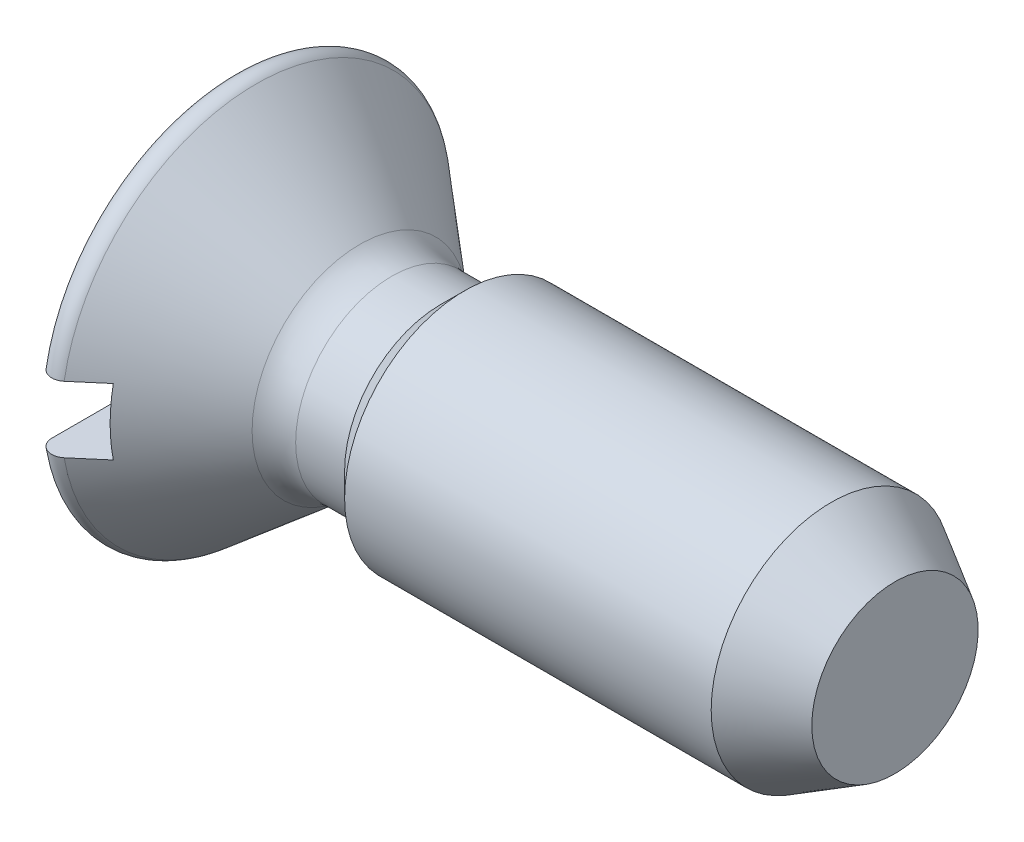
ISO-10303-21;
HEADER;
FILE_DESCRIPTION(('STEP AP214'),'2;1');
FILE_NAME('part.step','',(''),(''),'','','');
FILE_SCHEMA(('AUTOMOTIVE_DESIGN { 1 0 10303 214 1 1 1 1 }'));
ENDSEC;
DATA;
#1=APPLICATION_CONTEXT('core data for automotive mechanical design processes');
#2=APPLICATION_PROTOCOL_DEFINITION('international standard','automotive_design',2000,#1);
#3=PRODUCT_CONTEXT('',#1,'mechanical');
#4=PRODUCT('Part','Part','',(#3));
#5=PRODUCT_RELATED_PRODUCT_CATEGORY('part','',(#4));
#6=PRODUCT_DEFINITION_FORMATION('','',#4);
#7=PRODUCT_DEFINITION_CONTEXT('part definition',#1,'design');
#8=PRODUCT_DEFINITION('design','',#6,#7);
#9=PRODUCT_DEFINITION_SHAPE('','',#8);
#10=(LENGTH_UNIT() NAMED_UNIT(*) SI_UNIT(.MILLI.,.METRE.));
#11=(NAMED_UNIT(*) PLANE_ANGLE_UNIT() SI_UNIT($,.RADIAN.));
#12=(NAMED_UNIT(*) SI_UNIT($,.STERADIAN.) SOLID_ANGLE_UNIT());
#13=UNCERTAINTY_MEASURE_WITH_UNIT(LENGTH_MEASURE(1.E-05),#10,'distance_accuracy_value','');
#14=(GEOMETRIC_REPRESENTATION_CONTEXT(3) GLOBAL_UNCERTAINTY_ASSIGNED_CONTEXT((#13)) GLOBAL_UNIT_ASSIGNED_CONTEXT((#10,
#11,#12)) REPRESENTATION_CONTEXT('',''));
#15=CARTESIAN_POINT('',(0.,0.,0.));
#16=DIRECTION('',(0.,0.,1.));
#17=DIRECTION('',(1.,0.,0.));
#18=AXIS2_PLACEMENT_3D('',#15,#16,#17);
#19=CARTESIAN_POINT('',(0.,0.,0.));
#20=DIRECTION('',(-1.,0.,0.));
#21=DIRECTION('',(0.,0.,1.));
#22=AXIS2_PLACEMENT_3D('',#19,#20,#21);
#23=CYLINDRICAL_SURFACE('',#22,1.45);
#24=CARTESIAN_POINT('',(2.8,0.,0.));
#25=DIRECTION('',(-1.,0.,0.));
#26=DIRECTION('',(0.,0.,1.));
#27=AXIS2_PLACEMENT_3D('',#24,#25,#26);
#28=CIRCLE('',#27,1.45);
#29=CARTESIAN_POINT('',(2.8,0.,1.45));
#30=VERTEX_POINT('',#29);
#31=EDGE_CURVE('E209',#30,#30,#28,.T.);
#32=ORIENTED_EDGE('',*,*,#31,.F.);
#33=EDGE_LOOP('',(#32));
#34=FACE_BOUND('',#33,.T.);
#35=CARTESIAN_POINT('',(7.22923739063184,0.,0.));
#36=DIRECTION('',(-1.,0.,0.));
#37=DIRECTION('',(0.,0.,1.));
#38=AXIS2_PLACEMENT_3D('',#35,#36,#37);
#39=CIRCLE('',#38,1.45);
#40=CARTESIAN_POINT('',(7.22923739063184,0.,1.45));
#41=VERTEX_POINT('',#40);
#42=EDGE_CURVE('E324',#41,#41,#39,.T.);
#43=ORIENTED_EDGE('',*,*,#42,.T.);
#44=EDGE_LOOP('',(#43));
#45=FACE_BOUND('',#44,.T.);
#46=ADVANCED_FACE('F70',(#34,#45),#23,.T.);
#47=CARTESIAN_POINT('',(0.17,0.,0.));
#48=DIRECTION('',(-1.,0.,0.));
#49=DIRECTION('',(0.,0.,1.));
#50=AXIS2_PLACEMENT_3D('',#47,#48,#49);
#51=TOROIDAL_SURFACE('',#50,2.22190319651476,0.17);
#52=CARTESIAN_POINT('',(0.279273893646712,0.,0.));
#53=DIRECTION('',(-1.,0.,0.));
#54=DIRECTION('',(0.,0.,1.));
#55=AXIS2_PLACEMENT_3D('',#52,#53,#54);
#56=CIRCLE('',#55,2.35213075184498);
#57=CARTESIAN_POINT('',(0.279273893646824,0.4,2.31786951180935));
#58=VERTEX_POINT('',#57);
#59=CARTESIAN_POINT('',(0.279273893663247,0.4,-2.31786951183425));
#60=VERTEX_POINT('',#59);
#61=EDGE_CURVE('E197',#58,#60,#56,.T.);
#62=ORIENTED_EDGE('',*,*,#61,.T.);
#63=CARTESIAN_POINT('',(0.0659222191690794,0.4,-2.32212033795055));
#64=CARTESIAN_POINT('',(0.0583198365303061,0.4,-2.3161465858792));
#65=CARTESIAN_POINT('',(0.0512215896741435,0.4,-2.30951878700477));
#66=CARTESIAN_POINT('',(0.0382374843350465,0.4,-2.29515578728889));
#67=CARTESIAN_POINT('',(0.0323533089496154,0.4,-2.28741907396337));
#68=CARTESIAN_POINT('',(0.0219681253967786,0.4,-2.27107878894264));
#69=CARTESIAN_POINT('',(0.017465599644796,0.4,-2.26247618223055));
#70=CARTESIAN_POINT('',(0.00995282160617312,0.4,-2.24464584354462));
#71=CARTESIAN_POINT('',(0.00694219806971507,0.4,-2.23541826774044));
#72=CARTESIAN_POINT('',(0.00246190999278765,0.4,-2.21649259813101));
#73=CARTESIAN_POINT('',(0.00100896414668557,0.4,-2.20679054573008));
#74=CARTESIAN_POINT('',(-0.000263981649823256,0.4,-2.1872792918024));
#75=CARTESIAN_POINT('',(-8.38074140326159E-05,0.4,-2.17747007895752));
#76=CARTESIAN_POINT('',(0.00191244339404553,0.4,-2.15792760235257));
#77=CARTESIAN_POINT('',(0.00374360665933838,0.4,-2.14819587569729));
#78=CARTESIAN_POINT('',(0.00901422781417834,0.4,-2.12917773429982));
#79=CARTESIAN_POINT('',(0.0124537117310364,0.4,-2.11989132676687));
#80=CARTESIAN_POINT('',(0.0208482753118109,0.4,-2.10203610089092));
#81=CARTESIAN_POINT('',(0.0258025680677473,0.4,-2.09346691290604));
#82=CARTESIAN_POINT('',(0.0370951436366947,0.4,-2.07729438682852));
#83=CARTESIAN_POINT('',(0.0434333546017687,0.4,-2.06969099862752));
#84=CARTESIAN_POINT('',(0.0572400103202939,0.4,-2.05576290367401));
#85=CARTESIAN_POINT('',(0.0646946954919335,0.4,-2.04942456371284));
#86=CARTESIAN_POINT('',(0.0805788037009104,0.4,-2.03811665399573));
#87=CARTESIAN_POINT('',(0.0890081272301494,0.4,-2.03314694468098));
#88=CARTESIAN_POINT('',(0.106440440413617,0.4,-2.02481211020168));
#89=CARTESIAN_POINT('',(0.115430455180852,0.4,-2.02141984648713));
#90=CARTESIAN_POINT('',(0.1338574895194,0.4,-2.01621961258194));
#91=CARTESIAN_POINT('',(0.143294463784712,0.4,-2.01441148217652));
#92=CARTESIAN_POINT('',(0.162191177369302,0.4,-2.01245395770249));
#93=CARTESIAN_POINT('',(0.171648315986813,0.4,-2.01227938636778));
#94=CARTESIAN_POINT('',(0.190456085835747,0.4,-2.013528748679));
#95=CARTESIAN_POINT('',(0.199806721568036,0.4,-2.0149526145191));
#96=CARTESIAN_POINT('',(0.218092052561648,0.4,-2.01934279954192));
#97=CARTESIAN_POINT('',(0.227028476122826,0.4,-2.02230193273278));
#98=CARTESIAN_POINT('',(0.244283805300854,0.4,-2.02966612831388));
#99=CARTESIAN_POINT('',(0.252602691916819,0.4,-2.03407123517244));
#100=CARTESIAN_POINT('',(0.268465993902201,0.4,-2.04423741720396));
#101=CARTESIAN_POINT('',(0.276003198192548,0.4,-2.05000973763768));
#102=CARTESIAN_POINT('',(0.290021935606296,0.4,-2.06271843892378));
#103=CARTESIAN_POINT('',(0.296503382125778,0.4,-2.06965491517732));
#104=CARTESIAN_POINT('',(0.308344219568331,0.4,-2.08461999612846));
#105=CARTESIAN_POINT('',(0.313682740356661,0.4,-2.0926651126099));
#106=CARTESIAN_POINT('',(0.32295953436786,0.4,-2.10952569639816));
#107=CARTESIAN_POINT('',(0.326897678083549,0.4,-2.11834123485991));
#108=CARTESIAN_POINT('',(0.333327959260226,0.4,-2.13665156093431));
#109=CARTESIAN_POINT('',(0.335794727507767,0.4,-2.14615526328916));
#110=CARTESIAN_POINT('',(0.339113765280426,0.4,-2.16544071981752));
#111=CARTESIAN_POINT('',(0.339965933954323,0.4,-2.17522249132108));
#112=CARTESIAN_POINT('',(0.340032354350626,0.4,-2.1948802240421));
#113=CARTESIAN_POINT('',(0.339231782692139,0.4,-2.20475623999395));
#114=CARTESIAN_POINT('',(0.335980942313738,0.4,-2.22423326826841));
#115=CARTESIAN_POINT('',(0.33353066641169,0.4,-2.23383427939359));
#116=CARTESIAN_POINT('',(0.327048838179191,0.4,-2.25246625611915));
#117=CARTESIAN_POINT('',(0.323020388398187,0.4,-2.26149830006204));
#118=CARTESIAN_POINT('',(0.313488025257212,0.4,-2.27874742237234));
#119=CARTESIAN_POINT('',(0.307984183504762,0.4,-2.28696454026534));
#120=CARTESIAN_POINT('',(0.295719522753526,0.4,-2.30225179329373));
#121=CARTESIAN_POINT('',(0.288973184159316,0.4,-2.30933354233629));
#122=CARTESIAN_POINT('',(0.274371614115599,0.4,-2.32224315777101));
#123=CARTESIAN_POINT('',(0.266516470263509,0.4,-2.32807112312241));
#124=CARTESIAN_POINT('',(0.250044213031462,0.4,-2.33821703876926));
#125=CARTESIAN_POINT('',(0.241439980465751,0.4,-2.34255590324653));
#126=CARTESIAN_POINT('',(0.22361914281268,0.4,-2.34970648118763));
#127=CARTESIAN_POINT('',(0.214402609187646,0.4,-2.35251837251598));
#128=CARTESIAN_POINT('',(0.195742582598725,0.4,-2.35650224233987));
#129=CARTESIAN_POINT('',(0.186303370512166,0.4,-2.3576942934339));
#130=CARTESIAN_POINT('',(0.167356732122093,0.4,-2.35846698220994));
#131=CARTESIAN_POINT('',(0.157849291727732,0.4,-2.35804727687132));
#132=CARTESIAN_POINT('',(0.139091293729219,0.4,-2.3556156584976));
#133=CARTESIAN_POINT('',(0.129839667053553,0.4,-2.35361193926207));
#134=CARTESIAN_POINT('',(0.111811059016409,0.4,-2.34808445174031));
#135=CARTESIAN_POINT('',(0.103033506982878,0.4,-2.34456255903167));
#136=CARTESIAN_POINT('',(0.0895433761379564,0.4,-2.33779256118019));
#137=CARTESIAN_POINT('',(0.0846012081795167,0.4,-2.33499152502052));
#138=CARTESIAN_POINT('',(0.0750221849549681,0.4,-2.32890890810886));
#139=CARTESIAN_POINT('',(0.0703853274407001,0.4,-2.32562733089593));
#140=CARTESIAN_POINT('',(0.0659222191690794,0.4,-2.32212033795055));
#141=B_SPLINE_CURVE_WITH_KNOTS('',3,(#63,#64,#65,#66,#67,#68,#69,#70,#71,#72,#73,#74,#75,#76,
#77,#78,#79,#80,#81,#82,#83,#84,#85,#86,#87,#88,#89,#90,#91,#92,#93,#94,#95,#96,#97,#98,#99,
#100,#101,#102,#103,#104,#105,#106,#107,#108,#109,#110,#111,#112,#113,#114,#115,#116,#117,#118,
#119,#120,#121,#122,#123,#124,#125,#126,#127,#128,#129,#130,#131,#132,#133,#134,#135,#136,#137,
#138,#139,#140),.UNSPECIFIED.,.T.,.F.,(4,2,2,2,2,2,2,2,2,2,2,2,2,2,2,2,2,2,2,2,2,2,2,2,2,2,2,2,
2,2,2,2,2,2,2,2,2,2,4),(0.,0.0289847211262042,0.0580093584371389,0.0870020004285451,
0.11598742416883,0.145280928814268,0.174577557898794,0.204144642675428,0.233712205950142,
0.263264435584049,0.292815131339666,0.322027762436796,0.351237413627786,0.379924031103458,
0.408607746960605,0.436848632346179,0.465088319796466,0.493197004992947,0.521306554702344,
0.549655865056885,0.578007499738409,0.606839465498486,0.635674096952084,0.664992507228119,
0.694312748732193,0.723897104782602,0.753481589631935,0.783008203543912,0.812533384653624,
0.841734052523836,0.870932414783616,0.899702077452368,0.928468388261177,0.956874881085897,
0.985287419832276,1.01355394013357,1.0417856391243,1.05880173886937,1.07581771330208),.UNSPECIFIED.);
#142=CARTESIAN_POINT('',(0.,0.4,-2.18560147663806));
#143=VERTEX_POINT('',#142);
#144=EDGE_CURVE('E93',#60,#143,#141,.T.);
#145=ORIENTED_EDGE('',*,*,#144,.T.);
#146=CARTESIAN_POINT('',(0.,0.,0.));
#147=DIRECTION('',(-1.,0.,0.));
#148=DIRECTION('',(0.,0.,1.));
#149=AXIS2_PLACEMENT_3D('',#146,#147,#148);
#150=CIRCLE('',#149,2.22190319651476);
#151=CARTESIAN_POINT('',(0.,0.4,2.18560147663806));
#152=VERTEX_POINT('',#151);
#153=EDGE_CURVE('E193',#152,#143,#150,.T.);
#154=ORIENTED_EDGE('',*,*,#153,.F.);
#155=CARTESIAN_POINT('',(0.0818966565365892,0.4,2.03762447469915));
#156=CARTESIAN_POINT('',(0.0736818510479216,0.4,2.04269808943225));
#157=CARTESIAN_POINT('',(0.0658948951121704,0.4,2.0484793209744));
#158=CARTESIAN_POINT('',(0.0514006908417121,0.4,2.06127754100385));
#159=CARTESIAN_POINT('',(0.0446949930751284,0.4,2.06829627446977));
#160=CARTESIAN_POINT('',(0.0325586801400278,0.4,2.08334693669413));
#161=CARTESIAN_POINT('',(0.0271265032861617,0.4,2.09137760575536));
#162=CARTESIAN_POINT('',(0.0176696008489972,0.4,2.10822501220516));
#163=CARTESIAN_POINT('',(0.0136445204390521,0.4,2.11704155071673));
#164=CARTESIAN_POINT('',(0.00706018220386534,0.4,2.13533159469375));
#165=CARTESIAN_POINT('',(0.00451999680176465,0.4,2.14481196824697));
#166=CARTESIAN_POINT('',(0.00105068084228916,0.4,2.16406370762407));
#167=CARTESIAN_POINT('',(0.000121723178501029,0.4,2.17383510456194));
#168=CARTESIAN_POINT('',(-0.000100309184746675,0.4,2.1934874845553));
#169=CARTESIAN_POINT('',(0.000621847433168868,0.4,2.20336864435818));
#170=CARTESIAN_POINT('',(0.00371739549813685,0.4,2.22286918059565));
#171=CARTESIAN_POINT('',(0.00609079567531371,0.4,2.2324885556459));
#172=CARTESIAN_POINT('',(0.0124234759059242,0.4,2.25117258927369));
#173=CARTESIAN_POINT('',(0.016380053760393,0.4,2.26023816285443));
#174=CARTESIAN_POINT('',(0.0257751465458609,0.4,2.27756618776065));
#175=CARTESIAN_POINT('',(0.0312135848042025,0.4,2.28582868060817));
#176=CARTESIAN_POINT('',(0.0433575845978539,0.4,2.30121813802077));
#177=CARTESIAN_POINT('',(0.0500487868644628,0.4,2.30835643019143));
#178=CARTESIAN_POINT('',(0.0645505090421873,0.4,2.32138773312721));
#179=CARTESIAN_POINT('',(0.0723609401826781,0.4,2.32728084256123));
#180=CARTESIAN_POINT('',(0.0887561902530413,0.4,2.33756268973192));
#181=CARTESIAN_POINT('',(0.0973279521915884,0.4,2.3419722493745));
#182=CARTESIAN_POINT('',(0.115096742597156,0.4,2.34926871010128));
#183=CARTESIAN_POINT('',(0.124293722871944,0.4,2.35215572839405));
#184=CARTESIAN_POINT('',(0.142927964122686,0.4,2.35629069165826));
#185=CARTESIAN_POINT('',(0.152360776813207,0.4,2.35755869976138));
#186=CARTESIAN_POINT('',(0.171304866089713,0.4,2.35848281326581));
#187=CARTESIAN_POINT('',(0.180816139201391,0.4,2.35813898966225));
#188=CARTESIAN_POINT('',(0.199588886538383,0.4,2.35585693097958));
#189=CARTESIAN_POINT('',(0.208851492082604,0.4,2.35392798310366));
#190=CARTESIAN_POINT('',(0.226922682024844,0.4,2.34854648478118));
#191=CARTESIAN_POINT('',(0.235731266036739,0.4,2.34509393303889));
#192=CARTESIAN_POINT('',(0.252672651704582,0.4,2.3367575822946));
#193=CARTESIAN_POINT('',(0.260803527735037,0.4,2.33186987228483));
#194=CARTESIAN_POINT('',(0.276140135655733,0.4,2.32081188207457));
#195=CARTESIAN_POINT('',(0.283345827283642,0.4,2.31464154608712));
#196=CARTESIAN_POINT('',(0.29670894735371,0.4,2.30112756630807));
#197=CARTESIAN_POINT('',(0.30285480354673,0.4,2.2937724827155));
#198=CARTESIAN_POINT('',(0.313845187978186,0.4,2.27814727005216));
#199=CARTESIAN_POINT('',(0.318689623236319,0.4,2.26987707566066));
#200=CARTESIAN_POINT('',(0.327013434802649,0.4,2.2525297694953));
#201=CARTESIAN_POINT('',(0.330472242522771,0.4,2.24344278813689));
#202=CARTESIAN_POINT('',(0.335837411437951,0.4,2.22482154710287));
#203=CARTESIAN_POINT('',(0.337743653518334,0.4,2.21528725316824));
#204=CARTESIAN_POINT('',(0.339972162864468,0.4,2.19590850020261));
#205=CARTESIAN_POINT('',(0.340273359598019,0.4,2.18606161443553));
#206=CARTESIAN_POINT('',(0.339229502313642,0.4,2.16645524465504));
#207=CARTESIAN_POINT('',(0.337884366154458,0.4,2.15669576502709));
#208=CARTESIAN_POINT('',(0.333570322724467,0.4,2.137478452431));
#209=CARTESIAN_POINT('',(0.330591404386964,0.4,2.12802286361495));
#210=CARTESIAN_POINT('',(0.323081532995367,0.4,2.1097490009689));
#211=CARTESIAN_POINT('',(0.318550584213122,0.4,2.10093072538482));
#212=CARTESIAN_POINT('',(0.308081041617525,0.4,2.08422859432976));
#213=CARTESIAN_POINT('',(0.302148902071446,0.4,2.07634069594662));
#214=CARTESIAN_POINT('',(0.289026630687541,0.4,2.06169117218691));
#215=CARTESIAN_POINT('',(0.281836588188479,0.4,2.05492946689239));
#216=CARTESIAN_POINT('',(0.266512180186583,0.4,2.04283228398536));
#217=CARTESIAN_POINT('',(0.258393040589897,0.4,2.03747752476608));
#218=CARTESIAN_POINT('',(0.241358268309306,0.4,2.0282368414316));
#219=CARTESIAN_POINT('',(0.232442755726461,0.4,2.02435069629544));
#220=CARTESIAN_POINT('',(0.214243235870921,0.4,2.01823018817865));
#221=CARTESIAN_POINT('',(0.204968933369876,0.4,2.01596695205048));
#222=CARTESIAN_POINT('',(0.186168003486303,0.4,2.01305096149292));
#223=CARTESIAN_POINT('',(0.176641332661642,0.4,2.01239848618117));
#224=CARTESIAN_POINT('',(0.157730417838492,0.4,2.01272376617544));
#225=CARTESIAN_POINT('',(0.148345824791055,0.4,2.01368227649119));
#226=CARTESIAN_POINT('',(0.129879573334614,0.4,2.01716203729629));
#227=CARTESIAN_POINT('',(0.120797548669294,0.4,2.0196813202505));
#228=CARTESIAN_POINT('',(0.106750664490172,0.4,2.02487802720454));
#229=CARTESIAN_POINT('',(0.101604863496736,0.4,2.02708033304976));
#230=CARTESIAN_POINT('',(0.0915570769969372,0.4,2.0319841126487));
#231=CARTESIAN_POINT('',(0.0866550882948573,0.4,2.03468557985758));
#232=CARTESIAN_POINT('',(0.0818966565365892,0.4,2.03762447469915));
#233=B_SPLINE_CURVE_WITH_KNOTS('',3,(#155,#156,#157,#158,#159,#160,#161,#162,#163,#164,#165,
#166,#167,#168,#169,#170,#171,#172,#173,#174,#175,#176,#177,#178,#179,#180,#181,#182,#183,#184,
#185,#186,#187,#188,#189,#190,#191,#192,#193,#194,#195,#196,#197,#198,#199,#200,#201,#202,#203,
#204,#205,#206,#207,#208,#209,#210,#211,#212,#213,#214,#215,#216,#217,#218,#219,#220,#221,#222,
#223,#224,#225,#226,#227,#228,#229,#230,#231,#232),.UNSPECIFIED.,.T.,.F.,(4,2,2,2,2,2,2,2,2,2,2,
2,2,2,2,2,2,2,2,2,2,2,2,2,2,2,2,2,2,2,2,2,2,2,2,2,2,2,4),(0.,0.0289449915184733,
0.0579311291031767,0.086881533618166,0.11582463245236,0.145131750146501,0.174442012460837,
0.204023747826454,0.23360563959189,0.263137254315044,0.292667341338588,0.321877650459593,
0.351085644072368,0.379864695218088,0.408641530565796,0.437058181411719,0.465473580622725,
0.493723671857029,0.521973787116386,0.55030161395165,0.578630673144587,0.607251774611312,
0.635874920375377,0.664908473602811,0.693944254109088,0.723360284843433,0.75277778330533,
0.782377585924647,0.811977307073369,0.841443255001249,0.870907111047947,0.899943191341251,
0.928974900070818,0.957476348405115,0.985982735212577,1.01415099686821,1.04228382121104,
1.05905044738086,1.07581685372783),.UNSPECIFIED.);
#234=EDGE_CURVE('E142',#152,#58,#233,.T.);
#235=ORIENTED_EDGE('',*,*,#234,.T.);
#236=EDGE_LOOP('',(#62,#145,#154,#235));
#237=FACE_BOUND('',#236,.T.);
#238=ADVANCED_FACE('F221',(#237),#51,.T.);
#239=CARTESIAN_POINT('',(0.,0.,0.));
#240=DIRECTION('',(1.,0.,0.));
#241=DIRECTION('',(0.,0.,-1.));
#242=AXIS2_PLACEMENT_3D('',#239,#240,#241);
#243=PLANE('',#242);
#244=ORIENTED_EDGE('',*,*,#153,.T.);
#245=DIRECTION('',(0.,0.,1.));
#246=VECTOR('',#245,1.);
#247=CARTESIAN_POINT('',(0.,0.4,0.));
#248=LINE('',#247,#246);
#249=EDGE_CURVE('E213',#143,#152,#248,.T.);
#250=ORIENTED_EDGE('',*,*,#249,.T.);
#251=EDGE_LOOP('',(#244,#250));
#252=FACE_BOUND('',#251,.T.);
#253=ADVANCED_FACE('F226',(#252),#243,.F.);
#254=CARTESIAN_POINT('',(2.8,0.,0.));
#255=DIRECTION('',(1.,0.,0.));
#256=DIRECTION('',(0.,0.,-1.));
#257=AXIS2_PLACEMENT_3D('',#254,#255,#256);
#258=CONICAL_SURFACE('',#257,1.45,0.785398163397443);
#259=CARTESIAN_POINT('',(2.51,0.,0.));
#260=DIRECTION('',(-1.,0.,0.));
#261=DIRECTION('',(0.,0.,1.));
#262=AXIS2_PLACEMENT_3D('',#259,#260,#261);
#263=CIRCLE('',#262,1.16);
#264=CARTESIAN_POINT('',(2.51,0.,1.16));
#265=VERTEX_POINT('',#264);
#266=EDGE_CURVE('E206',#265,#265,#263,.T.);
#267=ORIENTED_EDGE('',*,*,#266,.F.);
#268=EDGE_LOOP('',(#267));
#269=FACE_BOUND('',#268,.T.);
#270=ORIENTED_EDGE('',*,*,#31,.T.);
#271=EDGE_LOOP('',(#270));
#272=FACE_BOUND('',#271,.T.);
#273=ADVANCED_FACE('F237',(#269,#272),#258,.T.);
#274=CARTESIAN_POINT('',(0.,0.,0.));
#275=DIRECTION('',(-1.,0.,0.));
#276=DIRECTION('',(0.,0.,1.));
#277=AXIS2_PLACEMENT_3D('',#274,#275,#276);
#278=CYLINDRICAL_SURFACE('',#277,1.16);
#279=CARTESIAN_POINT('',(1.91838214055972,0.,0.));
#280=DIRECTION('',(-1.,0.,0.));
#281=DIRECTION('',(0.,0.,1.));
#282=AXIS2_PLACEMENT_3D('',#279,#280,#281);
#283=CIRCLE('',#282,1.16);
#284=CARTESIAN_POINT('',(1.91838214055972,0.,1.16));
#285=VERTEX_POINT('',#284);
#286=EDGE_CURVE('E203',#285,#285,#283,.T.);
#287=ORIENTED_EDGE('',*,*,#286,.F.);
#288=EDGE_LOOP('',(#287));
#289=FACE_BOUND('',#288,.T.);
#290=ORIENTED_EDGE('',*,*,#266,.T.);
#291=EDGE_LOOP('',(#290));
#292=FACE_BOUND('',#291,.T.);
#293=ADVANCED_FACE('F240',(#289,#292),#278,.T.);
#294=CARTESIAN_POINT('',(1.91838214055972,0.,0.));
#295=DIRECTION('',(-1.,0.,0.));
#296=DIRECTION('',(0.,0.,1.));
#297=AXIS2_PLACEMENT_3D('',#294,#295,#296);
#298=TOROIDAL_SURFACE('',#297,1.76,0.6);
#299=CARTESIAN_POINT('',(1.5327095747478,0.,0.));
#300=DIRECTION('',(-1.,0.,0.));
#301=DIRECTION('',(0.,0.,1.));
#302=AXIS2_PLACEMENT_3D('',#299,#300,#301);
#303=CIRCLE('',#302,1.30037333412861);
#304=CARTESIAN_POINT('',(1.5327095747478,0.,1.30037333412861));
#305=VERTEX_POINT('',#304);
#306=EDGE_CURVE('E200',#305,#305,#303,.T.);
#307=ORIENTED_EDGE('',*,*,#306,.F.);
#308=EDGE_LOOP('',(#307));
#309=FACE_BOUND('',#308,.T.);
#310=ORIENTED_EDGE('',*,*,#286,.T.);
#311=EDGE_LOOP('',(#310));
#312=FACE_BOUND('',#311,.T.);
#313=ADVANCED_FACE('F227',(#309,#312),#298,.F.);
#314=CARTESIAN_POINT('',(1.5327095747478,0.,0.));
#315=DIRECTION('',(-1.,0.,0.));
#316=DIRECTION('',(0.,0.,1.));
#317=AXIS2_PLACEMENT_3D('',#314,#315,#316);
#318=CONICAL_SURFACE('',#317,1.30037333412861,0.698131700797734);
#319=CARTESIAN_POINT('',(0.6,0.,0.));
#320=DIRECTION('',(1.,0.,0.));
#321=DIRECTION('',(0.,0.,-1.));
#322=AXIS2_PLACEMENT_3D('',#319,#320,#321);
#323=CIRCLE('',#322,2.08300959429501);
#324=CARTESIAN_POINT('',(0.6,-0.4,-2.04424288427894));
#325=VERTEX_POINT('',#324);
#326=CARTESIAN_POINT('',(0.6,0.4,-2.04424288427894));
#327=VERTEX_POINT('',#326);
#328=EDGE_CURVE('E43',#325,#327,#323,.T.);
#329=ORIENTED_EDGE('',*,*,#328,.T.);
#330=CARTESIAN_POINT('',(-2.55003532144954,0.4,4.7092457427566));
#331=CARTESIAN_POINT('',(-2.36866257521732,0.4,4.5565043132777));
#332=CARTESIAN_POINT('',(-2.18731269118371,0.4,4.40373570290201));
#333=CARTESIAN_POINT('',(-1.82468195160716,0.4,4.09811033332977));
#334=CARTESIAN_POINT('',(-1.64340109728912,0.4,3.94525357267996));
#335=CARTESIAN_POINT('',(-1.28082171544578,0.4,3.63932528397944));
#336=CARTESIAN_POINT('',(-1.09952325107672,0.4,3.48625368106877));
#337=CARTESIAN_POINT('',(-0.737074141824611,0.4,3.17994146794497));
#338=CARTESIAN_POINT('',(-0.555923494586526,0.4,3.02670086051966));
#339=CARTESIAN_POINT('',(-0.189959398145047,0.4,2.71665911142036));
#340=CARTESIAN_POINT('',(-0.00515084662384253,0.4,2.55985218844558));
#341=CARTESIAN_POINT('',(0.364085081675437,0.4,2.24577137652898));
#342=CARTESIAN_POINT('',(0.548512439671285,0.4,2.08849746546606));
#343=CARTESIAN_POINT('',(0.824542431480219,0.4,1.85195640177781));
#344=CARTESIAN_POINT('',(0.916430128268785,0.4,1.7730220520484));
#345=CARTESIAN_POINT('',(1.09992081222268,0.4,1.61482330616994));
#346=CARTESIAN_POINT('',(1.19152380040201,0.4,1.53555891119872));
#347=CARTESIAN_POINT('',(1.3742794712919,0.4,1.3765269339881));
#348=CARTESIAN_POINT('',(1.46543218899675,0.4,1.29675939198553));
#349=CARTESIAN_POINT('',(1.6470030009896,0.4,1.13639386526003));
#350=CARTESIAN_POINT('',(1.73742111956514,0.4,1.05579590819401));
#351=CARTESIAN_POINT('',(1.87608053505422,0.4,0.930016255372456));
#352=CARTESIAN_POINT('',(1.92481780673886,0.4,0.885382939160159));
#353=CARTESIAN_POINT('',(2.02165860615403,0.4,0.795391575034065));
#354=CARTESIAN_POINT('',(2.06976185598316,0.4,0.75003322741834));
#355=CARTESIAN_POINT('',(2.16493799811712,0.4,0.658198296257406));
#356=CARTESIAN_POINT('',(2.21201048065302,0.4,0.611721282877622));
#357=CARTESIAN_POINT('',(2.28114976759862,0.4,0.540600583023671));
#358=CARTESIAN_POINT('',(2.30394335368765,0.4,0.51666834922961));
#359=CARTESIAN_POINT('',(2.34882117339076,0.4,0.468150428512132));
#360=CARTESIAN_POINT('',(2.37090540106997,0.4,0.443564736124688));
#361=CARTESIAN_POINT('',(2.42240662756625,0.4,0.383816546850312));
#362=CARTESIAN_POINT('',(2.45135989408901,0.4,0.348237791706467));
#363=CARTESIAN_POINT('',(2.49190782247,0.4,0.292809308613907));
#364=CARTESIAN_POINT('',(2.50492952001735,0.4,0.274013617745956));
#365=CARTESIAN_POINT('',(2.52956992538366,0.4,0.235532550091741));
#366=CARTESIAN_POINT('',(2.54118993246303,0.4,0.215848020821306));
#367=CARTESIAN_POINT('',(2.56227212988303,0.4,0.175577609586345));
#368=CARTESIAN_POINT('',(2.57175475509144,0.4,0.155002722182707));
#369=CARTESIAN_POINT('',(2.5877391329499,0.4,0.112722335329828));
#370=CARTESIAN_POINT('',(2.59424657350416,0.4,0.0910190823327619));
#371=CARTESIAN_POINT('',(2.6032585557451,0.4,0.0463845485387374));
#372=CARTESIAN_POINT('',(2.60569842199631,0.4,0.0234393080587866));
#373=CARTESIAN_POINT('',(2.60576628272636,0.4,-0.022431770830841));
#374=CARTESIAN_POINT('',(2.6033991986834,0.4,-0.0453576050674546));
#375=CARTESIAN_POINT('',(2.59390530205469,0.4,-0.0930674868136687));
#376=CARTESIAN_POINT('',(2.58623358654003,0.4,-0.11773750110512));
#377=CARTESIAN_POINT('',(2.57196135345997,0.4,-0.153629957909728));
#378=CARTESIAN_POINT('',(2.56672423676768,0.4,-0.165440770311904));
#379=CARTESIAN_POINT('',(2.55550186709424,0.4,-0.188700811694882));
#380=CARTESIAN_POINT('',(2.54951679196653,0.4,-0.200150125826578));
#381=CARTESIAN_POINT('',(2.53108467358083,0.4,-0.233254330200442));
#382=CARTESIAN_POINT('',(2.51782350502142,0.4,-0.254452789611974));
#383=CARTESIAN_POINT('',(2.48984173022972,0.4,-0.295872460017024));
#384=CARTESIAN_POINT('',(2.47511946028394,0.4,-0.316092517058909));
#385=CARTESIAN_POINT('',(2.42940407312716,0.4,-0.375766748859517));
#386=CARTESIAN_POINT('',(2.39695105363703,0.4,-0.414092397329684));
#387=CARTESIAN_POINT('',(2.32979796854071,0.4,-0.489337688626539));
#388=CARTESIAN_POINT('',(2.29507894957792,0.4,-0.526239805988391));
#389=CARTESIAN_POINT('',(2.22456791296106,0.4,-0.598834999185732));
#390=CARTESIAN_POINT('',(2.18877858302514,0.4,-0.634530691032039));
#391=CARTESIAN_POINT('',(2.11724700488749,0.4,-0.704436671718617));
#392=CARTESIAN_POINT('',(2.08151972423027,0.4,-0.738662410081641));
#393=CARTESIAN_POINT('',(2.00959655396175,0.4,-0.806618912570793));
#394=CARTESIAN_POINT('',(1.97340065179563,0.4,-0.840349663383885));
#395=CARTESIAN_POINT('',(1.86431577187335,0.4,-0.941023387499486));
#396=CARTESIAN_POINT('',(1.7909400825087,0.4,-1.00743779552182));
#397=CARTESIAN_POINT('',(1.64339029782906,0.4,-1.13955245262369));
#398=CARTESIAN_POINT('',(1.56921533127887,0.4,-1.20525172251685));
#399=CARTESIAN_POINT('',(1.42042618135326,0.4,-1.33613828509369));
#400=CARTESIAN_POINT('',(1.34581203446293,0.4,-1.40132561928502));
#401=CARTESIAN_POINT('',(1.12295313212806,0.4,-1.59516793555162));
#402=CARTESIAN_POINT('',(0.974291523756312,0.4,-1.72334293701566));
#403=CARTESIAN_POINT('',(0.676484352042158,0.4,-1.97898426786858));
#404=CARTESIAN_POINT('',(0.527339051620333,0.4,-2.10645090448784));
#405=CARTESIAN_POINT('',(0.13634292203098,0.4,-2.43976405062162));
#406=CARTESIAN_POINT('',(-0.105767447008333,0.4,-2.64530601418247));
#407=CARTESIAN_POINT('',(-0.590430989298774,0.4,-3.05595827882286));
#408=CARTESIAN_POINT('',(-0.832984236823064,0.4,-3.26106849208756));
#409=CARTESIAN_POINT('',(-1.32122757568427,0.4,-3.67347534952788));
#410=CARTESIAN_POINT('',(-1.56692042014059,0.4,-3.88076873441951));
#411=CARTESIAN_POINT('',(-2.05840937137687,0.4,-4.29513674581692));
#412=CARTESIAN_POINT('',(-2.30420544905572,0.4,-4.50221140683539));
#413=CARTESIAN_POINT('',(-2.55003532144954,0.4,-4.70924574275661));
#414=B_SPLINE_CURVE_WITH_KNOTS('',3,(#330,#331,#332,#333,#334,#335,#336,#337,#338,#339,#340,
#341,#342,#343,#344,#345,#346,#347,#348,#349,#350,#351,#352,#353,#354,#355,#356,#357,#358,#359,
#360,#361,#362,#363,#364,#365,#366,#367,#368,#369,#370,#371,#372,#373,#374,#375,#376,#377,#378,
#379,#380,#381,#382,#383,#384,#385,#386,#387,#388,#389,#390,#391,#392,#393,#394,#395,#396,#397,
#398,#399,#400,#401,#402,#403,#404,#405,#406,#407,#408,#409,#410,#411,#412,#413),.UNSPECIFIED.,
.F.,.F.,(4,2,2,2,2,2,2,2,2,2,2,2,2,2,2,2,2,2,2,2,2,2,2,2,2,2,2,2,2,2,2,2,2,2,2,2,2,2,2,2,2,4),
(0.,0.711360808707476,1.42273370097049,2.1345625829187,2.84637989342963,3.57348591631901,
4.30062694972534,4.66403513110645,5.0274420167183,5.39082019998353,5.75418631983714,
5.95244162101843,6.15078110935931,6.34919806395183,6.44833523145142,6.54747322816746,
6.68491641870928,6.75347314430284,6.8219658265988,6.8897729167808,6.95744982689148,
7.02619289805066,7.09486562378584,7.17190735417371,7.21064990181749,7.24938325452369,
7.324295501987,7.39929405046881,7.54979223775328,7.70176989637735,7.85339355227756,
8.00181513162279,8.15024069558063,8.44713530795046,8.74439519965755,9.04163073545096,
9.63049121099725,10.2190724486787,11.1718479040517,12.1248013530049,13.089176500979,
14.0533654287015),.UNSPECIFIED.);
#415=EDGE_CURVE('E192',#327,#60,#414,.T.);
#416=ORIENTED_EDGE('',*,*,#415,.T.);
#417=ORIENTED_EDGE('',*,*,#61,.F.);
#418=CARTESIAN_POINT('',(0.6,0.4,2.04424288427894));
#419=VERTEX_POINT('',#418);
#420=EDGE_CURVE('E145',#58,#419,#414,.T.);
#421=ORIENTED_EDGE('',*,*,#420,.T.);
#422=CARTESIAN_POINT('',(0.6,-0.4,2.04424288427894));
#423=VERTEX_POINT('',#422);
#424=EDGE_CURVE('E74',#419,#423,#323,.T.);
#425=ORIENTED_EDGE('',*,*,#424,.T.);
#426=CARTESIAN_POINT('',(-2.55003532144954,-0.4,-4.7092457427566));
#427=CARTESIAN_POINT('',(-2.36866257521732,-0.4,-4.5565043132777));
#428=CARTESIAN_POINT('',(-2.18731269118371,-0.4,-4.40373570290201));
#429=CARTESIAN_POINT('',(-1.82468195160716,-0.4,-4.09811033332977));
#430=CARTESIAN_POINT('',(-1.64340109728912,-0.4,-3.94525357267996));
#431=CARTESIAN_POINT('',(-1.28082171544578,-0.4,-3.63932528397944));
#432=CARTESIAN_POINT('',(-1.09952325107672,-0.4,-3.48625368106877));
#433=CARTESIAN_POINT('',(-0.737074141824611,-0.4,-3.17994146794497));
#434=CARTESIAN_POINT('',(-0.555923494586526,-0.4,-3.02670086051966));
#435=CARTESIAN_POINT('',(-0.189959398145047,-0.4,-2.71665911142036));
#436=CARTESIAN_POINT('',(-0.00515084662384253,-0.4,-2.55985218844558));
#437=CARTESIAN_POINT('',(0.364085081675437,-0.4,-2.24577137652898));
#438=CARTESIAN_POINT('',(0.548512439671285,-0.4,-2.08849746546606));
#439=CARTESIAN_POINT('',(0.824542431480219,-0.4,-1.85195640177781));
#440=CARTESIAN_POINT('',(0.916430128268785,-0.4,-1.7730220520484));
#441=CARTESIAN_POINT('',(1.09992081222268,-0.4,-1.61482330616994));
#442=CARTESIAN_POINT('',(1.19152380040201,-0.4,-1.53555891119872));
#443=CARTESIAN_POINT('',(1.3742794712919,-0.4,-1.3765269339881));
#444=CARTESIAN_POINT('',(1.46543218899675,-0.4,-1.29675939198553));
#445=CARTESIAN_POINT('',(1.6470030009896,-0.4,-1.13639386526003));
#446=CARTESIAN_POINT('',(1.73742111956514,-0.4,-1.05579590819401));
#447=CARTESIAN_POINT('',(1.87608053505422,-0.4,-0.930016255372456));
#448=CARTESIAN_POINT('',(1.92481780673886,-0.4,-0.885382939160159));
#449=CARTESIAN_POINT('',(2.02165860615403,-0.4,-0.795391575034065));
#450=CARTESIAN_POINT('',(2.06976185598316,-0.4,-0.75003322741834));
#451=CARTESIAN_POINT('',(2.16493799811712,-0.4,-0.658198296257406));
#452=CARTESIAN_POINT('',(2.21201048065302,-0.4,-0.611721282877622));
#453=CARTESIAN_POINT('',(2.28114976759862,-0.4,-0.540600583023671));
#454=CARTESIAN_POINT('',(2.30394335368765,-0.4,-0.51666834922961));
#455=CARTESIAN_POINT('',(2.34882117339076,-0.4,-0.468150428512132));
#456=CARTESIAN_POINT('',(2.37090540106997,-0.4,-0.443564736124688));
#457=CARTESIAN_POINT('',(2.42240662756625,-0.4,-0.383816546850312));
#458=CARTESIAN_POINT('',(2.45135989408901,-0.4,-0.348237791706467));
#459=CARTESIAN_POINT('',(2.49190782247,-0.4,-0.292809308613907));
#460=CARTESIAN_POINT('',(2.50492952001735,-0.4,-0.274013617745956));
#461=CARTESIAN_POINT('',(2.52956992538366,-0.4,-0.235532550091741));
#462=CARTESIAN_POINT('',(2.54118993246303,-0.4,-0.215848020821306));
#463=CARTESIAN_POINT('',(2.56227212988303,-0.4,-0.175577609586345));
#464=CARTESIAN_POINT('',(2.57175475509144,-0.4,-0.155002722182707));
#465=CARTESIAN_POINT('',(2.5877391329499,-0.4,-0.112722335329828));
#466=CARTESIAN_POINT('',(2.59424657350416,-0.4,-0.0910190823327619));
#467=CARTESIAN_POINT('',(2.6032585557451,-0.4,-0.0463845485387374));
#468=CARTESIAN_POINT('',(2.60569842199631,-0.4,-0.0234393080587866));
#469=CARTESIAN_POINT('',(2.60576628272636,-0.4,0.022431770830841));
#470=CARTESIAN_POINT('',(2.6033991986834,-0.4,0.0453576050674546));
#471=CARTESIAN_POINT('',(2.59390530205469,-0.4,0.0930674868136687));
#472=CARTESIAN_POINT('',(2.58623358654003,-0.4,0.11773750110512));
#473=CARTESIAN_POINT('',(2.57196135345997,-0.4,0.153629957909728));
#474=CARTESIAN_POINT('',(2.56672423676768,-0.4,0.165440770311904));
#475=CARTESIAN_POINT('',(2.55550186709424,-0.4,0.188700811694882));
#476=CARTESIAN_POINT('',(2.54951679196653,-0.4,0.200150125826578));
#477=CARTESIAN_POINT('',(2.53108467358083,-0.4,0.233254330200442));
#478=CARTESIAN_POINT('',(2.51782350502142,-0.4,0.254452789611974));
#479=CARTESIAN_POINT('',(2.48984173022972,-0.4,0.295872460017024));
#480=CARTESIAN_POINT('',(2.47511946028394,-0.4,0.316092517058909));
#481=CARTESIAN_POINT('',(2.42940407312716,-0.4,0.375766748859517));
#482=CARTESIAN_POINT('',(2.39695105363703,-0.4,0.414092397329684));
#483=CARTESIAN_POINT('',(2.32979796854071,-0.4,0.489337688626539));
#484=CARTESIAN_POINT('',(2.29507894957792,-0.4,0.526239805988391));
#485=CARTESIAN_POINT('',(2.22456791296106,-0.4,0.598834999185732));
#486=CARTESIAN_POINT('',(2.18877858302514,-0.4,0.634530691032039));
#487=CARTESIAN_POINT('',(2.11724700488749,-0.4,0.704436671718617));
#488=CARTESIAN_POINT('',(2.08151972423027,-0.4,0.738662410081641));
#489=CARTESIAN_POINT('',(2.00959655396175,-0.4,0.806618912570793));
#490=CARTESIAN_POINT('',(1.97340065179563,-0.4,0.840349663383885));
#491=CARTESIAN_POINT('',(1.86431577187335,-0.4,0.941023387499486));
#492=CARTESIAN_POINT('',(1.7909400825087,-0.4,1.00743779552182));
#493=CARTESIAN_POINT('',(1.64339029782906,-0.4,1.13955245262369));
#494=CARTESIAN_POINT('',(1.56921533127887,-0.4,1.20525172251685));
#495=CARTESIAN_POINT('',(1.42042618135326,-0.4,1.33613828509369));
#496=CARTESIAN_POINT('',(1.34581203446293,-0.4,1.40132561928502));
#497=CARTESIAN_POINT('',(1.12295313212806,-0.4,1.59516793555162));
#498=CARTESIAN_POINT('',(0.974291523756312,-0.4,1.72334293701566));
#499=CARTESIAN_POINT('',(0.676484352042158,-0.4,1.97898426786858));
#500=CARTESIAN_POINT('',(0.527339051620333,-0.4,2.10645090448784));
#501=CARTESIAN_POINT('',(0.13634292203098,-0.4,2.43976405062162));
#502=CARTESIAN_POINT('',(-0.105767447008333,-0.4,2.64530601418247));
#503=CARTESIAN_POINT('',(-0.590430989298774,-0.4,3.05595827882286));
#504=CARTESIAN_POINT('',(-0.832984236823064,-0.4,3.26106849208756));
#505=CARTESIAN_POINT('',(-1.32122757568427,-0.4,3.67347534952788));
#506=CARTESIAN_POINT('',(-1.56692042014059,-0.4,3.88076873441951));
#507=CARTESIAN_POINT('',(-2.05840937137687,-0.4,4.29513674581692));
#508=CARTESIAN_POINT('',(-2.30420544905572,-0.4,4.50221140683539));
#509=CARTESIAN_POINT('',(-2.55003532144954,-0.4,4.70924574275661));
#510=B_SPLINE_CURVE_WITH_KNOTS('',3,(#426,#427,#428,#429,#430,#431,#432,#433,#434,#435,#436,
#437,#438,#439,#440,#441,#442,#443,#444,#445,#446,#447,#448,#449,#450,#451,#452,#453,#454,#455,
#456,#457,#458,#459,#460,#461,#462,#463,#464,#465,#466,#467,#468,#469,#470,#471,#472,#473,#474,
#475,#476,#477,#478,#479,#480,#481,#482,#483,#484,#485,#486,#487,#488,#489,#490,#491,#492,#493,
#494,#495,#496,#497,#498,#499,#500,#501,#502,#503,#504,#505,#506,#507,#508,#509),.UNSPECIFIED.,
.F.,.F.,(4,2,2,2,2,2,2,2,2,2,2,2,2,2,2,2,2,2,2,2,2,2,2,2,2,2,2,2,2,2,2,2,2,2,2,2,2,2,2,2,2,4),
(0.,0.711360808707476,1.42273370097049,2.1345625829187,2.84637989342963,3.57348591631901,
4.30062694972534,4.66403513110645,5.0274420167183,5.39082019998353,5.75418631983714,
5.95244162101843,6.15078110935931,6.34919806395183,6.44833523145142,6.54747322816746,
6.68491641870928,6.75347314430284,6.8219658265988,6.8897729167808,6.95744982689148,
7.02619289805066,7.09486562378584,7.17190735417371,7.21064990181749,7.24938325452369,
7.324295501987,7.39929405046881,7.54979223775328,7.70176989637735,7.85339355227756,
8.00181513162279,8.15024069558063,8.44713530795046,8.74439519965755,9.04163073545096,
9.63049121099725,10.2190724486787,11.1718479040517,12.1248013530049,13.089176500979,
14.0533654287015),.UNSPECIFIED.);
#511=CARTESIAN_POINT('',(0.279273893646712,-0.4,2.31786951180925));
#512=VERTEX_POINT('',#511);
#513=EDGE_CURVE('E134',#423,#512,#510,.T.);
#514=ORIENTED_EDGE('',*,*,#513,.T.);
#515=CARTESIAN_POINT('',(0.279273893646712,-0.4,-2.31786951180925));
#516=VERTEX_POINT('',#515);
#517=EDGE_CURVE('E141',#516,#512,#56,.T.);
#518=ORIENTED_EDGE('',*,*,#517,.F.);
#519=EDGE_CURVE('E132',#516,#325,#510,.T.);
#520=ORIENTED_EDGE('',*,*,#519,.T.);
#521=EDGE_LOOP('',(#329,#416,#417,#421,#425,#514,#518,#520));
#522=FACE_BOUND('',#521,.T.);
#523=ORIENTED_EDGE('',*,*,#306,.T.);
#524=EDGE_LOOP('',(#523));
#525=FACE_BOUND('',#524,.T.);
#526=ADVANCED_FACE('F138',(#522,#525),#318,.T.);
#527=CARTESIAN_POINT('',(0.,-0.4,-2.18560147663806));
#528=VERTEX_POINT('',#527);
#529=CARTESIAN_POINT('',(0.,-0.4,2.18560147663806));
#530=VERTEX_POINT('',#529);
#531=EDGE_CURVE('E196',#528,#530,#150,.T.);
#532=ORIENTED_EDGE('',*,*,#531,.F.);
#533=CARTESIAN_POINT('',(0.0659222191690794,-0.4,-2.32212033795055));
#534=CARTESIAN_POINT('',(0.0733766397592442,-0.4,-2.32797674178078));
#535=CARTESIAN_POINT('',(0.0813263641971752,-0.4,-2.33321293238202));
#536=CARTESIAN_POINT('',(0.0979969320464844,-0.4,-2.34228337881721));
#537=CARTESIAN_POINT('',(0.106718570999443,-0.4,-2.34611616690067));
#538=CARTESIAN_POINT('',(0.124683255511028,-0.4,-2.35225825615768));
#539=CARTESIAN_POINT('',(0.133926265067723,-0.4,-2.35456766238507));
#540=CARTESIAN_POINT('',(0.152667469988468,-0.4,-2.35759106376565));
#541=CARTESIAN_POINT('',(0.162165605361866,-0.4,-2.35830543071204));
#542=CARTESIAN_POINT('',(0.18109236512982,-0.4,-2.35811845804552));
#543=CARTESIAN_POINT('',(0.190521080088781,-0.4,-2.35722618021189));
#544=CARTESIAN_POINT('',(0.209094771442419,-0.4,-2.3538708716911));
#545=CARTESIAN_POINT('',(0.218239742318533,-0.4,-2.35140781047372));
#546=CARTESIAN_POINT('',(0.235987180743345,-0.4,-2.34498617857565));
#547=CARTESIAN_POINT('',(0.244589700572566,-0.4,-2.34102775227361));
#548=CARTESIAN_POINT('',(0.261015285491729,-0.4,-2.33173399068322));
#549=CARTESIAN_POINT('',(0.268838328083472,-0.4,-2.32639861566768));
#550=CARTESIAN_POINT('',(0.28355308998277,-0.4,-2.31445910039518));
#551=CARTESIAN_POINT('',(0.290436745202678,-0.4,-2.30784502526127));
#552=CARTESIAN_POINT('',(0.303013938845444,-0.4,-2.2935687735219));
#553=CARTESIAN_POINT('',(0.308707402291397,-0.4,-2.28590653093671));
#554=CARTESIAN_POINT('',(0.318825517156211,-0.4,-2.26964123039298));
#555=CARTESIAN_POINT('',(0.323231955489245,-0.4,-2.26102684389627));
#556=CARTESIAN_POINT('',(0.330559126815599,-0.4,-2.24318792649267));
#557=CARTESIAN_POINT('',(0.333479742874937,-0.4,-2.23396334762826));
#558=CARTESIAN_POINT('',(0.337793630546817,-0.4,-2.21502617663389));
#559=CARTESIAN_POINT('',(0.339164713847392,-0.4,-2.20530852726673));
#560=CARTESIAN_POINT('',(0.340272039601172,-0.4,-2.18578036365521));
#561=CARTESIAN_POINT('',(0.340008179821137,-0.4,-2.17596984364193));
#562=CARTESIAN_POINT('',(0.337844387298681,-0.4,-2.15644079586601));
#563=CARTESIAN_POINT('',(0.335929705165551,-0.4,-2.14672389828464));
#564=CARTESIAN_POINT('',(0.330495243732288,-0.4,-2.12774938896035));
#565=CARTESIAN_POINT('',(0.326975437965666,-0.4,-2.11849178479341));
#566=CARTESIAN_POINT('',(0.318426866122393,-0.4,-2.1007102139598));
#567=CARTESIAN_POINT('',(0.313399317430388,-0.4,-2.09218566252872));
#568=CARTESIAN_POINT('',(0.301968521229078,-0.4,-2.0761144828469));
#569=CARTESIAN_POINT('',(0.295565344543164,-0.4,-2.068567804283));
#570=CARTESIAN_POINT('',(0.281641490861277,-0.4,-2.05476485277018));
#571=CARTESIAN_POINT('',(0.274134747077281,-0.4,-2.04849453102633));
#572=CARTESIAN_POINT('',(0.258158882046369,-0.4,-2.03733067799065));
#573=CARTESIAN_POINT('',(0.249689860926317,-0.4,-2.03243700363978));
#574=CARTESIAN_POINT('',(0.232192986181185,-0.4,-2.02425877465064));
#575=CARTESIAN_POINT('',(0.223177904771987,-0.4,-2.02094689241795));
#576=CARTESIAN_POINT('',(0.204714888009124,-0.4,-2.01591020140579));
#577=CARTESIAN_POINT('',(0.195266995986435,-0.4,-2.01418523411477));
#578=CARTESIAN_POINT('',(0.176361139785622,-0.4,-2.01239261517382));
#579=CARTESIAN_POINT('',(0.166905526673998,-0.4,-2.01230008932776));
#580=CARTESIAN_POINT('',(0.148114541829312,-0.4,-2.01371153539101));
#581=CARTESIAN_POINT('',(0.138779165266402,-0.4,-2.01521544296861));
#582=CARTESIAN_POINT('',(0.12053413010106,-0.4,-2.01976161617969));
#583=CARTESIAN_POINT('',(0.11162281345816,-0.4,-2.0227972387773));
#584=CARTESIAN_POINT('',(0.0944298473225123,-0.4,-2.03030872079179));
#585=CARTESIAN_POINT('',(0.0861482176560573,-0.4,-2.03478462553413));
#586=CARTESIAN_POINT('',(0.0703682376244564,-0.4,-2.04508689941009));
#587=CARTESIAN_POINT('',(0.0628774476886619,-0.4,-2.05092484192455));
#588=CARTESIAN_POINT('',(0.0489615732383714,-0.4,-2.06375611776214));
#589=CARTESIAN_POINT('',(0.042536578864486,-0.4,-2.07074954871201));
#590=CARTESIAN_POINT('',(0.0308175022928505,-0.4,-2.08582015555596));
#591=CARTESIAN_POINT('',(0.0255445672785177,-0.4,-2.09391377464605));
#592=CARTESIAN_POINT('',(0.016406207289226,-0.4,-2.11085997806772));
#593=CARTESIAN_POINT('',(0.012540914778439,-0.4,-2.11971263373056));
#594=CARTESIAN_POINT('',(0.0062633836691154,-0.4,-2.138084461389));
#595=CARTESIAN_POINT('',(0.00387645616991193,-0.4,-2.14761228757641));
#596=CARTESIAN_POINT('',(0.000720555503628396,-0.4,-2.16693206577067));
#597=CARTESIAN_POINT('',(-4.8380737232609E-05,-0.4,-2.17672402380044));
#598=CARTESIAN_POINT('',(5.35375975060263E-05,-0.4,-2.19638447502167));
#599=CARTESIAN_POINT('',(0.000938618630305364,-0.4,-2.20625289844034));
#600=CARTESIAN_POINT('',(0.00435689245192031,-0.4,-2.22570314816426));
#601=CARTESIAN_POINT('',(0.00689049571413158,-0.4,-2.2352849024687));
#602=CARTESIAN_POINT('',(0.0135351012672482,-0.4,-2.25386546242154));
#603=CARTESIAN_POINT('',(0.0176433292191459,-0.4,-2.26286526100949));
#604=CARTESIAN_POINT('',(0.0273266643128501,-0.4,-2.28002827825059));
#605=CARTESIAN_POINT('',(0.0328999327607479,-0.4,-2.28819252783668));
#606=CARTESIAN_POINT('',(0.0430928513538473,-0.4,-2.30067407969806));
#607=CARTESIAN_POINT('',(0.0473254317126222,-0.4,-2.30531280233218));
#608=CARTESIAN_POINT('',(0.0562737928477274,-0.4,-2.31409831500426));
#609=CARTESIAN_POINT('',(0.0609895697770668,-0.4,-2.31824510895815));
#610=CARTESIAN_POINT('',(0.0659222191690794,-0.4,-2.32212033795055));
#611=B_SPLINE_CURVE_WITH_KNOTS('',3,(#533,#534,#535,#536,#537,#538,#539,#540,#541,#542,#543,
#544,#545,#546,#547,#548,#549,#550,#551,#552,#553,#554,#555,#556,#557,#558,#559,#560,#561,#562,
#563,#564,#565,#566,#567,#568,#569,#570,#571,#572,#573,#574,#575,#576,#577,#578,#579,#580,#581,
#582,#583,#584,#585,#586,#587,#588,#589,#590,#591,#592,#593,#594,#595,#596,#597,#598,#599,#600,
#601,#602,#603,#604,#605,#606,#607,#608,#609,#610),.UNSPECIFIED.,.T.,.F.,(4,2,2,2,2,2,2,2,2,2,2,
2,2,2,2,2,2,2,2,2,2,2,2,2,2,2,2,2,2,2,2,2,2,2,2,2,2,2,4),(0.,0.0284167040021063,
0.0568630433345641,0.085307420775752,0.113745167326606,0.142023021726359,0.17030142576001,
0.198577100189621,0.22685359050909,0.25535931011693,0.283866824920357,0.312760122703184,
0.341655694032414,0.37095998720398,0.40026611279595,0.429836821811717,0.459408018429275,
0.488955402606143,0.518501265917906,0.547701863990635,0.576899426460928,0.605572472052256,
0.634242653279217,0.66247559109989,0.690707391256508,0.718817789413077,0.746929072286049,
0.775288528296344,0.80365038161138,0.832495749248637,0.861343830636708,0.890673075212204,
0.92000298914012,0.949586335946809,0.979177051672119,1.0087158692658,1.03821778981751,
1.05702149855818,1.07582505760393),.UNSPECIFIED.);
#612=EDGE_CURVE('E85',#528,#516,#611,.T.);
#613=ORIENTED_EDGE('',*,*,#612,.T.);
#614=ORIENTED_EDGE('',*,*,#517,.T.);
#615=CARTESIAN_POINT('',(0.0818966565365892,-0.4,2.03762447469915));
#616=CARTESIAN_POINT('',(0.0899156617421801,-0.4,2.03267278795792));
#617=CARTESIAN_POINT('',(0.0983537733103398,-0.4,2.02838807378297));
#618=CARTESIAN_POINT('',(0.115834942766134,-0.4,2.02128961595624));
#619=CARTESIAN_POINT('',(0.124878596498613,-0.4,2.01847734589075));
#620=CARTESIAN_POINT('',(0.143311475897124,-0.4,2.0144170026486));
#621=CARTESIAN_POINT('',(0.152700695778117,-0.4,2.01316890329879));
#622=CARTESIAN_POINT('',(0.171552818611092,-0.4,2.01227783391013));
#623=CARTESIAN_POINT('',(0.181015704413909,-0.4,2.01263450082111));
#624=CARTESIAN_POINT('',(0.199690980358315,-0.4,2.01493368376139));
#625=CARTESIAN_POINT('',(0.208904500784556,-0.4,2.0168670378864));
#626=CARTESIAN_POINT('',(0.226878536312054,-0.4,2.02224678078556));
#627=CARTESIAN_POINT('',(0.235639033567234,-0.4,2.02569322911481));
#628=CARTESIAN_POINT('',(0.252501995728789,-0.4,2.03401059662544));
#629=CARTESIAN_POINT('',(0.260601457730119,-0.4,2.03888759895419));
#630=CARTESIAN_POINT('',(0.275882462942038,-0.4,2.04991318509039));
#631=CARTESIAN_POINT('',(0.283063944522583,-0.4,2.05606185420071));
#632=CARTESIAN_POINT('',(0.296421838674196,-0.4,2.06955279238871));
#633=CARTESIAN_POINT('',(0.302581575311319,-0.4,2.07691156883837));
#634=CARTESIAN_POINT('',(0.313604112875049,-0.4,2.09254343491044));
#635=CARTESIAN_POINT('',(0.31846679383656,-0.4,2.10081660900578));
#636=CARTESIAN_POINT('',(0.326846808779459,-0.4,2.11820091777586));
#637=CARTESIAN_POINT('',(0.330338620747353,-0.4,2.12732435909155));
#638=CARTESIAN_POINT('',(0.335762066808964,-0.4,2.14602386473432));
#639=CARTESIAN_POINT('',(0.337693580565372,-0.4,2.15559996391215));
#640=CARTESIAN_POINT('',(0.339959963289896,-0.4,2.17505848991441));
#641=CARTESIAN_POINT('',(0.340275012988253,-0.4,2.18494323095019));
#642=CARTESIAN_POINT('',(0.339244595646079,-0.4,2.20462609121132));
#643=CARTESIAN_POINT('',(0.337899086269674,-0.4,2.21442420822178));
#644=CARTESIAN_POINT('',(0.333576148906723,-0.4,2.23367207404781));
#645=CARTESIAN_POINT('',(0.330595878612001,-0.4,2.24312118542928));
#646=CARTESIAN_POINT('',(0.32307801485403,-0.4,2.26137854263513));
#647=CARTESIAN_POINT('',(0.318540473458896,-0.4,2.27018680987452));
#648=CARTESIAN_POINT('',(0.308074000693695,-0.4,2.28683035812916));
#649=CARTESIAN_POINT('',(0.302157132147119,-0.4,2.29467322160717));
#650=CARTESIAN_POINT('',(0.289073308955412,-0.4,2.30923618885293));
#651=CARTESIAN_POINT('',(0.281906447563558,-0.4,2.31595637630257));
#652=CARTESIAN_POINT('',(0.266634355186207,-0.4,2.32798120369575));
#653=CARTESIAN_POINT('',(0.258543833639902,-0.4,2.33330452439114));
#654=CARTESIAN_POINT('',(0.241574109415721,-0.4,2.34249508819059));
#655=CARTESIAN_POINT('',(0.232694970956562,-0.4,2.34636244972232));
#656=CARTESIAN_POINT('',(0.214531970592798,-0.4,2.35247755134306));
#657=CARTESIAN_POINT('',(0.20525537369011,-0.4,2.35474687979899));
#658=CARTESIAN_POINT('',(0.186451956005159,-0.4,2.35768146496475));
#659=CARTESIAN_POINT('',(0.176925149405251,-0.4,2.35834681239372));
#660=CARTESIAN_POINT('',(0.157975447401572,-0.4,2.35805412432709));
#661=CARTESIAN_POINT('',(0.148552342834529,-0.4,2.35710942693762));
#662=CARTESIAN_POINT('',(0.129998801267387,-0.4,2.35365123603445));
#663=CARTESIAN_POINT('',(0.120868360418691,-0.4,2.35113776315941));
#664=CARTESIAN_POINT('',(0.103156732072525,-0.4,2.34461828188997));
#665=CARTESIAN_POINT('',(0.0945755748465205,-0.4,2.34061219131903));
#666=CARTESIAN_POINT('',(0.0782002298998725,-0.4,2.33122748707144));
#667=CARTESIAN_POINT('',(0.0704060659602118,-0.4,2.3258488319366));
#668=CARTESIAN_POINT('',(0.0557550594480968,-0.4,2.31382728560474));
#669=CARTESIAN_POINT('',(0.0489064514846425,-0.4,2.30717436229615));
#670=CARTESIAN_POINT('',(0.0364051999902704,-0.4,2.29282678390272));
#671=CARTESIAN_POINT('',(0.0307526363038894,-0.4,2.28513205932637));
#672=CARTESIAN_POINT('',(0.0207213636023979,-0.4,2.26880818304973));
#673=CARTESIAN_POINT('',(0.0163610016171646,-0.4,2.2601677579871));
#674=CARTESIAN_POINT('',(0.00912970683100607,-0.4,2.24228471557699));
#675=CARTESIAN_POINT('',(0.00625889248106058,-0.4,2.23304205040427));
#676=CARTESIAN_POINT('',(0.00204780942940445,-0.4,2.2140771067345));
#677=CARTESIAN_POINT('',(0.000729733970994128,-0.4,2.20434989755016));
#678=CARTESIAN_POINT('',(-0.000270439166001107,-0.4,2.1848119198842));
#679=CARTESIAN_POINT('',(4.75032803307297E-05,-0.4,2.17500114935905));
#680=CARTESIAN_POINT('',(0.00231924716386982,-0.4,2.15548301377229));
#681=CARTESIAN_POINT('',(0.00428740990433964,-0.4,2.14577731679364));
#682=CARTESIAN_POINT('',(0.00982720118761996,-0.4,2.12683159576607));
#683=CARTESIAN_POINT('',(0.0133992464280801,-0.4,2.11759169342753));
#684=CARTESIAN_POINT('',(0.0220495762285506,-0.4,2.09985241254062));
#685=CARTESIAN_POINT('',(0.0271270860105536,-0.4,2.09135265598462));
#686=CARTESIAN_POINT('',(0.0386499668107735,-0.4,2.07534744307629));
#687=CARTESIAN_POINT('',(0.0450936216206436,-0.4,2.06784075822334));
#688=CARTESIAN_POINT('',(0.0566388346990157,-0.4,2.05652325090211));
#689=CARTESIAN_POINT('',(0.0613930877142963,-0.4,2.05235238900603));
#690=CARTESIAN_POINT('',(0.0713343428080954,-0.4,2.04456261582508));
#691=CARTESIAN_POINT('',(0.0765213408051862,-0.4,2.04094369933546));
#692=CARTESIAN_POINT('',(0.0818966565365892,-0.4,2.03762447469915));
#693=B_SPLINE_CURVE_WITH_KNOTS('',3,(#615,#616,#617,#618,#619,#620,#621,#622,#623,#624,#625,
#626,#627,#628,#629,#630,#631,#632,#633,#634,#635,#636,#637,#638,#639,#640,#641,#642,#643,#644,
#645,#646,#647,#648,#649,#650,#651,#652,#653,#654,#655,#656,#657,#658,#659,#660,#661,#662,#663,
#664,#665,#666,#667,#668,#669,#670,#671,#672,#673,#674,#675,#676,#677,#678,#679,#680,#681,#682,
#683,#684,#685,#686,#687,#688,#689,#690,#691,#692),.UNSPECIFIED.,.T.,.F.,(4,2,2,2,2,2,2,2,2,2,2,
2,2,2,2,2,2,2,2,2,2,2,2,2,2,2,2,2,2,2,2,2,2,2,2,2,2,2,4),(0.,0.0282512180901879,
0.0565306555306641,0.0848096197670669,0.113082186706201,0.141191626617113,0.169302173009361,
0.197534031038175,0.225767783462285,0.254424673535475,0.283084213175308,0.312254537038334,
0.341427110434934,0.370956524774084,0.400486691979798,0.430068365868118,0.459649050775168,
0.488980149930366,0.518309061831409,0.547223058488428,0.57613470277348,0.604647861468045,
0.633159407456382,0.66143590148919,0.689712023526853,0.717989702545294,0.746268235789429,
0.774779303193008,0.803292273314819,0.832192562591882,0.861095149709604,0.890406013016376,
0.919717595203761,0.949286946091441,0.978863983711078,1.0084258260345,1.03795074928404,
1.0568883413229,1.07582575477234),.UNSPECIFIED.);
#694=EDGE_CURVE('E154',#512,#530,#693,.T.);
#695=ORIENTED_EDGE('',*,*,#694,.T.);
#696=EDGE_LOOP('',(#532,#613,#614,#695));
#697=FACE_BOUND('',#696,.T.);
#698=ADVANCED_FACE('F163',(#697),#51,.T.);
#699=ORIENTED_EDGE('',*,*,#531,.T.);
#700=DIRECTION('',(0.,0.,-1.));
#701=VECTOR('',#700,1.);
#702=CARTESIAN_POINT('',(0.,-0.4,0.));
#703=LINE('',#702,#701);
#704=EDGE_CURVE('E212',#530,#528,#703,.T.);
#705=ORIENTED_EDGE('',*,*,#704,.T.);
#706=EDGE_LOOP('',(#699,#705));
#707=FACE_BOUND('',#706,.T.);
#708=ADVANCED_FACE('F172',(#707),#243,.F.);
#709=CARTESIAN_POINT('',(0.6,0.4,-2.39190319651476));
#710=DIRECTION('',(1.,0.,0.));
#711=DIRECTION('',(0.,0.,-1.));
#712=AXIS2_PLACEMENT_3D('',#709,#710,#711);
#713=PLANE('',#712);
#714=DIRECTION('',(0.,0.,1.));
#715=VECTOR('',#714,1.);
#716=CARTESIAN_POINT('',(0.6,0.4,-2.39190319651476));
#717=LINE('',#716,#715);
#718=EDGE_CURVE('E128',#327,#419,#717,.T.);
#719=ORIENTED_EDGE('',*,*,#718,.F.);
#720=ORIENTED_EDGE('',*,*,#328,.F.);
#721=DIRECTION('',(0.,0.,1.));
#722=VECTOR('',#721,1.);
#723=CARTESIAN_POINT('',(0.6,-0.4,-2.39190319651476));
#724=LINE('',#723,#722);
#725=EDGE_CURVE('E125',#325,#423,#724,.T.);
#726=ORIENTED_EDGE('',*,*,#725,.T.);
#727=ORIENTED_EDGE('',*,*,#424,.F.);
#728=EDGE_LOOP('',(#719,#720,#726,#727));
#729=FACE_BOUND('',#728,.T.);
#730=ADVANCED_FACE('F124',(#729),#713,.F.);
#731=CARTESIAN_POINT('',(0.,0.4,-2.39190319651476));
#732=DIRECTION('',(0.,1.,0.));
#733=DIRECTION('',(0.,0.,1.));
#734=AXIS2_PLACEMENT_3D('',#731,#732,#733);
#735=PLANE('',#734);
#736=ORIENTED_EDGE('',*,*,#718,.T.);
#737=ORIENTED_EDGE('',*,*,#420,.F.);
#738=ORIENTED_EDGE('',*,*,#234,.F.);
#739=ORIENTED_EDGE('',*,*,#249,.F.);
#740=ORIENTED_EDGE('',*,*,#144,.F.);
#741=ORIENTED_EDGE('',*,*,#415,.F.);
#742=EDGE_LOOP('',(#736,#737,#738,#739,#740,#741));
#743=FACE_BOUND('',#742,.T.);
#744=ADVANCED_FACE('F170',(#743),#735,.F.);
#745=CARTESIAN_POINT('',(0.,-0.4,-2.39190319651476));
#746=DIRECTION('',(0.,-1.,0.));
#747=DIRECTION('',(0.,0.,-1.));
#748=AXIS2_PLACEMENT_3D('',#745,#746,#747);
#749=PLANE('',#748);
#750=ORIENTED_EDGE('',*,*,#612,.F.);
#751=ORIENTED_EDGE('',*,*,#704,.F.);
#752=ORIENTED_EDGE('',*,*,#694,.F.);
#753=ORIENTED_EDGE('',*,*,#513,.F.);
#754=ORIENTED_EDGE('',*,*,#725,.F.);
#755=ORIENTED_EDGE('',*,*,#519,.F.);
#756=EDGE_LOOP('',(#750,#751,#752,#753,#754,#755));
#757=FACE_BOUND('',#756,.T.);
#758=ADVANCED_FACE('F131',(#757),#749,.F.);
#759=CARTESIAN_POINT('',(7.22923739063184,0.,0.));
#760=DIRECTION('',(-1.,0.,0.));
#761=DIRECTION('',(0.,0.,1.));
#762=AXIS2_PLACEMENT_3D('',#759,#760,#761);
#763=CONICAL_SURFACE('',#762,1.45,0.523598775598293);
#764=CARTESIAN_POINT('',(8.,0.,0.));
#765=DIRECTION('',(-1.,0.,0.));
#766=DIRECTION('',(0.,0.,1.));
#767=AXIS2_PLACEMENT_3D('',#764,#765,#766);
#768=CIRCLE('',#767,1.005);
#769=CARTESIAN_POINT('',(8.,0.,1.005));
#770=VERTEX_POINT('',#769);
#771=EDGE_CURVE('E135',#770,#770,#768,.T.);
#772=ORIENTED_EDGE('',*,*,#771,.T.);
#773=EDGE_LOOP('',(#772));
#774=FACE_BOUND('',#773,.T.);
#775=ORIENTED_EDGE('',*,*,#42,.F.);
#776=EDGE_LOOP('',(#775));
#777=FACE_BOUND('',#776,.T.);
#778=ADVANCED_FACE('F169',(#774,#777),#763,.T.);
#779=CARTESIAN_POINT('',(8.,1.45,0.));
#780=DIRECTION('',(-1.,0.,0.));
#781=DIRECTION('',(0.,0.,1.));
#782=AXIS2_PLACEMENT_3D('',#779,#780,#781);
#783=PLANE('',#782);
#784=ORIENTED_EDGE('',*,*,#771,.F.);
#785=EDGE_LOOP('',(#784));
#786=FACE_BOUND('',#785,.T.);
#787=ADVANCED_FACE('F72',(#786),#783,.F.);
#788=CLOSED_SHELL('',(#46,#238,#253,#273,#293,#313,#526,#698,#708,#730,#744,#758,#778,#787));
#789=MANIFOLD_SOLID_BREP('B6',#788);
#790=ADVANCED_BREP_SHAPE_REPRESENTATION('',(#18,#789),#14);
#791=SHAPE_DEFINITION_REPRESENTATION(#9,#790);
ENDSEC;
END-ISO-10303-21;
